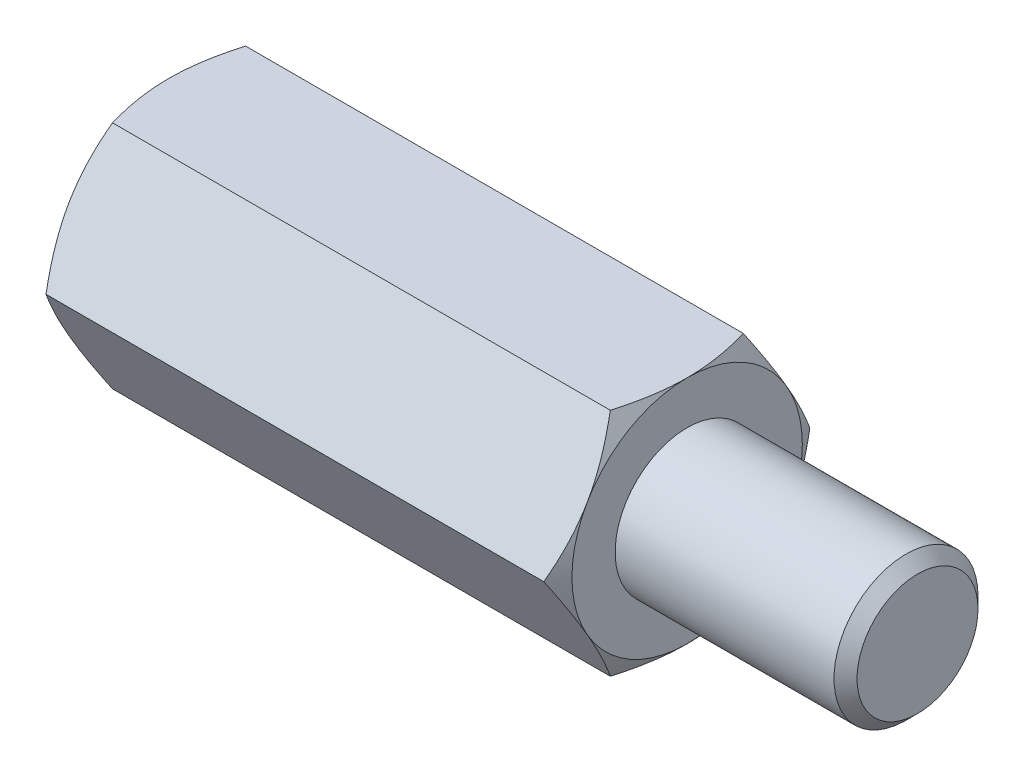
ISO-10303-21;
HEADER;
FILE_DESCRIPTION(('STEP AP214'),'2;1');
FILE_NAME('part.step','',(''),(''),'','','');
FILE_SCHEMA(('AUTOMOTIVE_DESIGN { 1 0 10303 214 1 1 1 1 }'));
ENDSEC;
DATA;
#1=APPLICATION_CONTEXT('core data for automotive mechanical design processes');
#2=APPLICATION_PROTOCOL_DEFINITION('international standard','automotive_design',2000,#1);
#3=PRODUCT_CONTEXT('',#1,'mechanical');
#4=PRODUCT('Part','Part','',(#3));
#5=PRODUCT_RELATED_PRODUCT_CATEGORY('part','',(#4));
#6=PRODUCT_DEFINITION_FORMATION('','',#4);
#7=PRODUCT_DEFINITION_CONTEXT('part definition',#1,'design');
#8=PRODUCT_DEFINITION('design','',#6,#7);
#9=PRODUCT_DEFINITION_SHAPE('','',#8);
#10=(LENGTH_UNIT() NAMED_UNIT(*) SI_UNIT(.MILLI.,.METRE.));
#11=(NAMED_UNIT(*) PLANE_ANGLE_UNIT() SI_UNIT($,.RADIAN.));
#12=(NAMED_UNIT(*) SI_UNIT($,.STERADIAN.) SOLID_ANGLE_UNIT());
#13=UNCERTAINTY_MEASURE_WITH_UNIT(LENGTH_MEASURE(1.E-05),#10,'distance_accuracy_value','');
#14=(GEOMETRIC_REPRESENTATION_CONTEXT(3) GLOBAL_UNCERTAINTY_ASSIGNED_CONTEXT((#13)) GLOBAL_UNIT_ASSIGNED_CONTEXT((#10,
#11,#12)) REPRESENTATION_CONTEXT('',''));
#15=CARTESIAN_POINT('',(0.,0.,0.));
#16=DIRECTION('',(0.,0.,1.));
#17=DIRECTION('',(1.,0.,0.));
#18=AXIS2_PLACEMENT_3D('',#15,#16,#17);
#19=CARTESIAN_POINT('',(9.,4.,-2.3094010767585));
#20=DIRECTION('',(1.,0.,0.));
#21=DIRECTION('',(0.,0.,-1.));
#22=AXIS2_PLACEMENT_3D('',#19,#20,#21);
#23=PLANE('',#22);
#24=CARTESIAN_POINT('',(9.,0.,0.));
#25=DIRECTION('',(1.,0.,0.));
#26=DIRECTION('',(0.,0.,-1.));
#27=AXIS2_PLACEMENT_3D('',#24,#25,#26);
#28=CIRCLE('',#27,4.);
#29=CARTESIAN_POINT('',(9.,-2.,-3.46410161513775));
#30=VERTEX_POINT('',#29);
#31=CARTESIAN_POINT('',(9.,2.,-3.46410161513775));
#32=VERTEX_POINT('',#31);
#33=EDGE_CURVE('E288',#30,#32,#28,.T.);
#34=ORIENTED_EDGE('',*,*,#33,.T.);
#35=CARTESIAN_POINT('',(9.,4.,0.));
#36=VERTEX_POINT('',#35);
#37=EDGE_CURVE('E53',#32,#36,#28,.T.);
#38=ORIENTED_EDGE('',*,*,#37,.T.);
#39=CARTESIAN_POINT('',(9.,2.,3.46410161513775));
#40=VERTEX_POINT('',#39);
#41=EDGE_CURVE('E296',#36,#40,#28,.T.);
#42=ORIENTED_EDGE('',*,*,#41,.T.);
#43=CARTESIAN_POINT('',(9.,-2.,3.46410161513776));
#44=VERTEX_POINT('',#43);
#45=EDGE_CURVE('E300',#40,#44,#28,.T.);
#46=ORIENTED_EDGE('',*,*,#45,.T.);
#47=CARTESIAN_POINT('',(9.,0.,0.));
#48=DIRECTION('',(-1.,0.,0.));
#49=DIRECTION('',(0.,-1.,0.));
#50=AXIS2_PLACEMENT_3D('',#47,#48,#49);
#51=CIRCLE('',#50,4.);
#52=CARTESIAN_POINT('',(9.,-4.,0.));
#53=VERTEX_POINT('',#52);
#54=EDGE_CURVE('E193',#53,#44,#51,.T.);
#55=ORIENTED_EDGE('',*,*,#54,.F.);
#56=EDGE_CURVE('E61',#53,#30,#28,.T.);
#57=ORIENTED_EDGE('',*,*,#56,.T.);
#58=EDGE_LOOP('',(#34,#38,#42,#46,#55,#57));
#59=FACE_BOUND('',#58,.T.);
#60=CARTESIAN_POINT('',(9.,0.,0.));
#61=DIRECTION('',(1.,0.,0.));
#62=DIRECTION('',(0.,0.,-1.));
#63=AXIS2_PLACEMENT_3D('',#60,#61,#62);
#64=CIRCLE('',#63,2.5);
#65=CARTESIAN_POINT('',(9.,0.,-2.5));
#66=VERTEX_POINT('',#65);
#67=EDGE_CURVE('E315',#66,#66,#64,.T.);
#68=ORIENTED_EDGE('',*,*,#67,.F.);
#69=EDGE_LOOP('',(#68));
#70=FACE_BOUND('',#69,.T.);
#71=ADVANCED_FACE('F37',(#59,#70),#23,.T.);
#72=CARTESIAN_POINT('',(9.,0.,-4.61880215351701));
#73=DIRECTION('',(0.,-0.5,0.866025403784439));
#74=DIRECTION('',(0.,-0.866025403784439,-0.5));
#75=AXIS2_PLACEMENT_3D('',#72,#73,#74);
#76=PLANE('',#75);
#77=CARTESIAN_POINT('',(8.64266774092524,-0.000200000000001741,-4.61891762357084));
#78=CARTESIAN_POINT('',(8.70128212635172,0.175579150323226,-4.5174314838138));
#79=CARTESIAN_POINT('',(8.75458967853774,0.352875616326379,-4.41506932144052));
#80=CARTESIAN_POINT('',(8.8476383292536,0.710538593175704,-4.2085725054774));
#81=CARTESIAN_POINT('',(8.8873465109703,0.890911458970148,-4.10443418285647));
#82=CARTESIAN_POINT('',(8.94915778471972,1.24942181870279,-3.89744813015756));
#83=CARTESIAN_POINT('',(8.97167226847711,1.42750415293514,-3.79463224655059));
#84=CARTESIAN_POINT('',(8.99854937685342,1.7845067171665,-3.58851671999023));
#85=CARTESIAN_POINT('',(9.00293425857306,1.9634256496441,-3.48521782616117));
#86=CARTESIAN_POINT('',(8.99380992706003,2.29774284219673,-3.29219970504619));
#87=CARTESIAN_POINT('',(8.98254104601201,2.45319115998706,-3.20245157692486));
#88=CARTESIAN_POINT('',(8.94682600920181,2.76307505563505,-3.02354002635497));
#89=CARTESIAN_POINT('',(8.92236765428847,2.91750956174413,-2.93437722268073));
#90=CARTESIAN_POINT('',(8.86122393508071,3.22803232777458,-2.75509682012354));
#91=CARTESIAN_POINT('',(8.82427939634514,3.3840812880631,-2.6650019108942));
#92=CARTESIAN_POINT('',(8.74042992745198,3.69385183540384,-2.486155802));
#93=CARTESIAN_POINT('',(8.69354469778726,3.84757739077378,-2.39740231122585));
#94=CARTESIAN_POINT('',(8.64266774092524,4.0002,-2.30928560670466));
#95=B_SPLINE_CURVE_WITH_KNOTS('',3,(#77,#78,#79,#80,#81,#82,#83,#84,#85,#86,#87,#88,#89,#90,#91,
#92,#93,#94),.UNSPECIFIED.,.F.,.F.,(4,2,2,2,2,2,2,2,4),(0.,0.634047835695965,1.26961969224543,
1.88946157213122,2.50854226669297,3.04757825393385,3.58711366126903,4.13861653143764,
4.68903648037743),.UNSPECIFIED.);
#96=CARTESIAN_POINT('',(8.64273441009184,0.,-4.61880215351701));
#97=VERTEX_POINT('',#96);
#98=EDGE_CURVE('E312',#97,#32,#95,.T.);
#99=ORIENTED_EDGE('',*,*,#98,.F.);
#100=DIRECTION('',(-1.,0.,0.));
#101=VECTOR('',#100,1.);
#102=CARTESIAN_POINT('',(9.,0.,-4.61880215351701));
#103=LINE('',#102,#101);
#104=CARTESIAN_POINT('',(-8.64273441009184,0.,-4.61880215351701));
#105=VERTEX_POINT('',#104);
#106=EDGE_CURVE('E264',#97,#105,#103,.T.);
#107=ORIENTED_EDGE('',*,*,#106,.T.);
#108=CARTESIAN_POINT('',(-8.64266774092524,4.0002,-2.30928560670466));
#109=CARTESIAN_POINT('',(-8.70128212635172,3.82442084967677,-2.4107717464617));
#110=CARTESIAN_POINT('',(-8.75458967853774,3.64712438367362,-2.51313390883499));
#111=CARTESIAN_POINT('',(-8.8476383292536,3.28946140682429,-2.71963072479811));
#112=CARTESIAN_POINT('',(-8.8873465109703,3.10908854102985,-2.82376904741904));
#113=CARTESIAN_POINT('',(-8.94915778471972,2.75057818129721,-3.03075510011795));
#114=CARTESIAN_POINT('',(-8.97167226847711,2.57249584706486,-3.13357098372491));
#115=CARTESIAN_POINT('',(-8.99854937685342,2.21549328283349,-3.33968651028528));
#116=CARTESIAN_POINT('',(-9.00293425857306,2.0365743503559,-3.44298540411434));
#117=CARTESIAN_POINT('',(-8.99380992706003,1.70225715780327,-3.63600352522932));
#118=CARTESIAN_POINT('',(-8.98254104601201,1.54680884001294,-3.72575165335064));
#119=CARTESIAN_POINT('',(-8.94682600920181,1.23692494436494,-3.90466320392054));
#120=CARTESIAN_POINT('',(-8.92236765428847,1.08249043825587,-3.99382600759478));
#121=CARTESIAN_POINT('',(-8.86122393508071,0.771967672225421,-4.17310641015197));
#122=CARTESIAN_POINT('',(-8.82427939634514,0.615918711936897,-4.26320131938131));
#123=CARTESIAN_POINT('',(-8.74042992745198,0.306148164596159,-4.4420474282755));
#124=CARTESIAN_POINT('',(-8.69354469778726,0.152422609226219,-4.53080091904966));
#125=CARTESIAN_POINT('',(-8.64266774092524,-0.000200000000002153,-4.61891762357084));
#126=B_SPLINE_CURVE_WITH_KNOTS('',3,(#108,#109,#110,#111,#112,#113,#114,#115,#116,#117,#118,
#119,#120,#121,#122,#123,#124,#125),.UNSPECIFIED.,.F.,.F.,(4,2,2,2,2,2,2,2,4),(0.,
0.634047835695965,1.26961969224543,1.88946157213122,2.50854226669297,3.04757825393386,
3.58711366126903,4.13861653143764,4.68903648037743),.UNSPECIFIED.);
#127=CARTESIAN_POINT('',(-9.,2.,-3.46410161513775));
#128=VERTEX_POINT('',#127);
#129=EDGE_CURVE('E326',#128,#105,#126,.T.);
#130=ORIENTED_EDGE('',*,*,#129,.F.);
#131=CARTESIAN_POINT('',(-8.64273441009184,4.,-2.3094010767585));
#132=VERTEX_POINT('',#131);
#133=EDGE_CURVE('E323',#132,#128,#126,.T.);
#134=ORIENTED_EDGE('',*,*,#133,.F.);
#135=DIRECTION('',(-1.,0.,0.));
#136=VECTOR('',#135,1.);
#137=CARTESIAN_POINT('',(9.,4.,-2.3094010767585));
#138=LINE('',#137,#136);
#139=CARTESIAN_POINT('',(8.64273441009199,4.,-2.30940107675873));
#140=VERTEX_POINT('',#139);
#141=EDGE_CURVE('E279',#140,#132,#138,.T.);
#142=ORIENTED_EDGE('',*,*,#141,.F.);
#143=EDGE_CURVE('E229',#32,#140,#95,.T.);
#144=ORIENTED_EDGE('',*,*,#143,.F.);
#145=EDGE_LOOP('',(#99,#107,#130,#134,#142,#144));
#146=FACE_BOUND('',#145,.T.);
#147=ADVANCED_FACE('F148',(#146),#76,.F.);
#148=CARTESIAN_POINT('',(9.,4.,-2.3094010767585));
#149=DIRECTION('',(0.,-1.,0.));
#150=DIRECTION('',(0.,0.,-1.));
#151=AXIS2_PLACEMENT_3D('',#148,#149,#150);
#152=PLANE('',#151);
#153=CARTESIAN_POINT('',(7.00829070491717,4.,-6.28479524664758));
#154=CARTESIAN_POINT('',(7.09370060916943,4.,-6.10939349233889));
#155=CARTESIAN_POINT('',(7.1783148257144,4.,-5.93359774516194));
#156=CARTESIAN_POINT('',(7.34550596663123,4.,-5.58100905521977));
#157=CARTESIAN_POINT('',(7.42808258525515,4.,-5.40421596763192));
#158=CARTESIAN_POINT('',(7.59115082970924,4.,-5.04855089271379));
#159=CARTESIAN_POINT('',(7.67162934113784,4.,-4.86967287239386));
#160=CARTESIAN_POINT('',(7.82940015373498,4.,-4.51052237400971));
#161=CARTESIAN_POINT('',(7.90669260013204,4.,-4.33024995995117));
#162=CARTESIAN_POINT('',(8.05980205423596,4.,-3.96189114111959));
#163=CARTESIAN_POINT('',(8.13548049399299,4.,-3.77374683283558));
#164=CARTESIAN_POINT('',(8.28130452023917,4.,-3.39528725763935));
#165=CARTESIAN_POINT('',(8.35144949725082,4.,-3.2049717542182));
#166=CARTESIAN_POINT('',(8.4844245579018,4.,-2.82219775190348));
#167=CARTESIAN_POINT('',(8.5472687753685,4.,-2.62974421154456));
#168=CARTESIAN_POINT('',(8.66367969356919,4.,-2.24207725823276));
#169=CARTESIAN_POINT('',(8.71724923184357,4.,-2.04686470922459));
#170=CARTESIAN_POINT('',(8.81230316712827,4.,-1.65467425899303));
#171=CARTESIAN_POINT('',(8.85385633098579,4.,-1.45771333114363));
#172=CARTESIAN_POINT('',(8.92259036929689,4.,-1.06125849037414));
#173=CARTESIAN_POINT('',(8.94977273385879,4.,-0.861764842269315));
#174=CARTESIAN_POINT('',(8.98724473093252,4.,-0.46387918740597));
#175=CARTESIAN_POINT('',(8.99775780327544,4.,-0.265508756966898));
#176=CARTESIAN_POINT('',(9.00159342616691,4.,0.131417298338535));
#177=CARTESIAN_POINT('',(8.99491584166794,4.,0.32997292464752));
#178=CARTESIAN_POINT('',(8.96964892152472,4.,0.664692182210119));
#179=CARTESIAN_POINT('',(8.95537089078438,4.,0.801202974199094));
#180=CARTESIAN_POINT('',(8.9195349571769,4.,1.07327201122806));
#181=CARTESIAN_POINT('',(8.89797613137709,4.,1.20883013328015));
#182=CARTESIAN_POINT('',(8.82350663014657,4.,1.61386939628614));
#183=CARTESIAN_POINT('',(8.76081499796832,4.,1.8815748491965));
#184=CARTESIAN_POINT('',(8.65151174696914,4.,2.28197262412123));
#185=CARTESIAN_POINT('',(8.61200931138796,4.,2.41672443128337));
#186=CARTESIAN_POINT('',(8.52875235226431,4.,2.6849206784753));
#187=CARTESIAN_POINT('',(8.48499779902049,4.,2.81836510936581));
#188=CARTESIAN_POINT('',(8.3939510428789,4.,3.08398596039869));
#189=CARTESIAN_POINT('',(8.34665989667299,4.,3.21616274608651));
#190=CARTESIAN_POINT('',(8.24911111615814,4.,3.47941134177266));
#191=CARTESIAN_POINT('',(8.1988535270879,4.,3.61048316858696));
#192=CARTESIAN_POINT('',(8.07132952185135,4.,3.93385125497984));
#193=CARTESIAN_POINT('',(7.9926014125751,4.,4.12557021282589));
#194=CARTESIAN_POINT('',(7.83096938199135,4.,4.5072455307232));
#195=CARTESIAN_POINT('',(7.74806513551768,4.,4.69720175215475));
#196=CARTESIAN_POINT('',(7.5789699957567,4.,5.0756995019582));
#197=CARTESIAN_POINT('',(7.49277827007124,4.,5.264240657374));
#198=CARTESIAN_POINT('',(7.3178011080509,4.,5.64011758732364));
#199=CARTESIAN_POINT('',(7.22901560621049,4.,5.82745333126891));
#200=CARTESIAN_POINT('',(6.95934323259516,4.,6.38844423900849));
#201=CARTESIAN_POINT('',(6.77535618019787,4.,6.76060781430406));
#202=CARTESIAN_POINT('',(6.4019562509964,4.,7.50211228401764));
#203=CARTESIAN_POINT('',(6.21254420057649,4.,7.87145359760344));
#204=CARTESIAN_POINT('',(5.84738774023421,4.,8.57450173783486));
#205=CARTESIAN_POINT('',(5.67197556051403,4.,8.90838144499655));
#206=CARTESIAN_POINT('',(5.31880976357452,4.,9.57491712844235));
#207=CARTESIAN_POINT('',(5.14105604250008,4.,9.90757304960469));
#208=CARTESIAN_POINT('',(4.78429339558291,4.,10.5709822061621));
#209=CARTESIAN_POINT('',(4.60528952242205,3.99999999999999,10.9017381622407));
#210=CARTESIAN_POINT('',(4.24590712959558,3.99999999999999,11.5624752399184));
#211=CARTESIAN_POINT('',(4.06552869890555,3.99999999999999,11.8924564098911));
#212=CARTESIAN_POINT('',(3.88464248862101,3.99999999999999,12.2221569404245));
#213=B_SPLINE_CURVE_WITH_KNOTS('',3,(#153,#154,#155,#156,#157,#158,#159,#160,#161,#162,#163,
#164,#165,#166,#167,#168,#169,#170,#171,#172,#173,#174,#175,#176,#177,#178,#179,#180,#181,#182,
#183,#184,#185,#186,#187,#188,#189,#190,#191,#192,#193,#194,#195,#196,#197,#198,#199,#200,#201,
#202,#203,#204,#205,#206,#207,#208,#209,#210,#211,#212),.UNSPECIFIED.,.F.,.F.,(4,2,2,2,2,2,2,2,
2,2,2,2,2,2,2,2,2,2,2,2,2,2,2,2,2,2,2,2,2,4),(0.,0.585280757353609,1.17064881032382,
1.75906864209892,2.34746162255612,2.95577704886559,3.56415938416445,4.17134357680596,
4.77834167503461,5.38179402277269,5.98518378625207,6.58041501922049,7.17565092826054,
7.5872191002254,7.99883946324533,8.82250155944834,9.24373134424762,9.66496407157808,
10.086071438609,10.5071723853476,11.1288656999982,11.7506074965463,12.3725077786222,
12.9944237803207,14.2398211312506,15.4850297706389,16.6164791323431,17.7479788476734,
18.8762380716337,20.0044248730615),.UNSPECIFIED.);
#214=EDGE_CURVE('E227',#140,#36,#213,.T.);
#215=ORIENTED_EDGE('',*,*,#214,.F.);
#216=ORIENTED_EDGE('',*,*,#141,.T.);
#217=CARTESIAN_POINT('',(-7.00829070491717,4.,-6.28479524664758));
#218=CARTESIAN_POINT('',(-7.09370060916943,4.,-6.10939349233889));
#219=CARTESIAN_POINT('',(-7.1783148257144,4.,-5.93359774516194));
#220=CARTESIAN_POINT('',(-7.34550596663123,4.,-5.58100905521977));
#221=CARTESIAN_POINT('',(-7.42808258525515,4.,-5.40421596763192));
#222=CARTESIAN_POINT('',(-7.59115082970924,4.,-5.04855089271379));
#223=CARTESIAN_POINT('',(-7.67162934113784,4.,-4.86967287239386));
#224=CARTESIAN_POINT('',(-7.82940015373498,4.,-4.51052237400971));
#225=CARTESIAN_POINT('',(-7.90669260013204,4.,-4.33024995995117));
#226=CARTESIAN_POINT('',(-8.05980205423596,4.,-3.96189114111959));
#227=CARTESIAN_POINT('',(-8.13548049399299,4.,-3.77374683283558));
#228=CARTESIAN_POINT('',(-8.28130452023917,4.,-3.39528725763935));
#229=CARTESIAN_POINT('',(-8.35144949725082,4.,-3.2049717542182));
#230=CARTESIAN_POINT('',(-8.4844245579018,4.,-2.82219775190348));
#231=CARTESIAN_POINT('',(-8.5472687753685,4.,-2.62974421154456));
#232=CARTESIAN_POINT('',(-8.66367969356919,4.,-2.24207725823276));
#233=CARTESIAN_POINT('',(-8.71724923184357,4.,-2.04686470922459));
#234=CARTESIAN_POINT('',(-8.81230316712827,4.,-1.65467425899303));
#235=CARTESIAN_POINT('',(-8.85385633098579,4.,-1.45771333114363));
#236=CARTESIAN_POINT('',(-8.92259036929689,4.,-1.06125849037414));
#237=CARTESIAN_POINT('',(-8.94977273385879,4.,-0.861764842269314));
#238=CARTESIAN_POINT('',(-8.98724473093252,4.,-0.46387918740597));
#239=CARTESIAN_POINT('',(-8.99775780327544,4.,-0.265508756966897));
#240=CARTESIAN_POINT('',(-9.00159342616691,4.,0.131417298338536));
#241=CARTESIAN_POINT('',(-8.99491584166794,4.,0.329972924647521));
#242=CARTESIAN_POINT('',(-8.96964892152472,4.,0.66469218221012));
#243=CARTESIAN_POINT('',(-8.95537089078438,4.,0.801202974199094));
#244=CARTESIAN_POINT('',(-8.9195349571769,4.,1.07327201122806));
#245=CARTESIAN_POINT('',(-8.89797613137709,4.,1.20883013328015));
#246=CARTESIAN_POINT('',(-8.82350663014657,4.,1.61386939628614));
#247=CARTESIAN_POINT('',(-8.76081499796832,4.,1.8815748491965));
#248=CARTESIAN_POINT('',(-8.65151174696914,4.,2.28197262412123));
#249=CARTESIAN_POINT('',(-8.61200931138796,4.,2.41672443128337));
#250=CARTESIAN_POINT('',(-8.52875235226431,4.,2.6849206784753));
#251=CARTESIAN_POINT('',(-8.48499779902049,4.,2.81836510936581));
#252=CARTESIAN_POINT('',(-8.3939510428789,4.,3.08398596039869));
#253=CARTESIAN_POINT('',(-8.34665989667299,4.,3.21616274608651));
#254=CARTESIAN_POINT('',(-8.24911111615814,4.,3.47941134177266));
#255=CARTESIAN_POINT('',(-8.1988535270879,4.,3.61048316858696));
#256=CARTESIAN_POINT('',(-8.07132952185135,4.,3.93385125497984));
#257=CARTESIAN_POINT('',(-7.9926014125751,4.,4.1255702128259));
#258=CARTESIAN_POINT('',(-7.83096938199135,4.,4.5072455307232));
#259=CARTESIAN_POINT('',(-7.74806513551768,4.,4.69720175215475));
#260=CARTESIAN_POINT('',(-7.5789699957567,4.,5.0756995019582));
#261=CARTESIAN_POINT('',(-7.49277827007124,4.,5.264240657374));
#262=CARTESIAN_POINT('',(-7.3178011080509,4.,5.64011758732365));
#263=CARTESIAN_POINT('',(-7.22901560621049,4.,5.82745333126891));
#264=CARTESIAN_POINT('',(-6.95934323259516,4.,6.3884442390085));
#265=CARTESIAN_POINT('',(-6.77535618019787,4.,6.76060781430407));
#266=CARTESIAN_POINT('',(-6.4019562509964,4.,7.50211228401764));
#267=CARTESIAN_POINT('',(-6.21254420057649,4.,7.87145359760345));
#268=CARTESIAN_POINT('',(-5.84738774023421,4.,8.57450173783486));
#269=CARTESIAN_POINT('',(-5.67197556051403,4.,8.90838144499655));
#270=CARTESIAN_POINT('',(-5.31880976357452,4.,9.57491712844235));
#271=CARTESIAN_POINT('',(-5.14105604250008,4.,9.90757304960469));
#272=CARTESIAN_POINT('',(-4.78429339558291,4.,10.5709822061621));
#273=CARTESIAN_POINT('',(-4.60528952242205,3.99999999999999,10.9017381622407));
#274=CARTESIAN_POINT('',(-4.24590712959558,3.99999999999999,11.5624752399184));
#275=CARTESIAN_POINT('',(-4.06552869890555,3.99999999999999,11.8924564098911));
#276=CARTESIAN_POINT('',(-3.88464248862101,3.99999999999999,12.2221569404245));
#277=B_SPLINE_CURVE_WITH_KNOTS('',3,(#217,#218,#219,#220,#221,#222,#223,#224,#225,#226,#227,
#228,#229,#230,#231,#232,#233,#234,#235,#236,#237,#238,#239,#240,#241,#242,#243,#244,#245,#246,
#247,#248,#249,#250,#251,#252,#253,#254,#255,#256,#257,#258,#259,#260,#261,#262,#263,#264,#265,
#266,#267,#268,#269,#270,#271,#272,#273,#274,#275,#276),.UNSPECIFIED.,.F.,.F.,(4,2,2,2,2,2,2,2,
2,2,2,2,2,2,2,2,2,2,2,2,2,2,2,2,2,2,2,2,2,4),(0.,0.585280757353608,1.17064881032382,
1.75906864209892,2.34746162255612,2.95577704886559,3.56415938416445,4.17134357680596,
4.77834167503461,5.38179402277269,5.98518378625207,6.58041501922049,7.17565092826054,
7.5872191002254,7.99883946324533,8.82250155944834,9.24373134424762,9.66496407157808,
10.086071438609,10.5071723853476,11.1288656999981,11.7506074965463,12.3725077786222,
12.9944237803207,14.2398211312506,15.4850297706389,16.6164791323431,17.7479788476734,
18.8762380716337,20.0044248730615),.UNSPECIFIED.);
#278=CARTESIAN_POINT('',(-9.,4.,0.));
#279=VERTEX_POINT('',#278);
#280=EDGE_CURVE('E241',#279,#132,#277,.F.);
#281=ORIENTED_EDGE('',*,*,#280,.F.);
#282=CARTESIAN_POINT('',(-8.64273441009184,4.,2.3094010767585));
#283=VERTEX_POINT('',#282);
#284=EDGE_CURVE('E249',#283,#279,#277,.F.);
#285=ORIENTED_EDGE('',*,*,#284,.F.);
#286=DIRECTION('',(-1.,0.,0.));
#287=VECTOR('',#286,1.);
#288=CARTESIAN_POINT('',(9.,4.,2.3094010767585));
#289=LINE('',#288,#287);
#290=CARTESIAN_POINT('',(8.64273441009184,4.,2.3094010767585));
#291=VERTEX_POINT('',#290);
#292=EDGE_CURVE('E276',#291,#283,#289,.T.);
#293=ORIENTED_EDGE('',*,*,#292,.F.);
#294=EDGE_CURVE('E221',#36,#291,#213,.T.);
#295=ORIENTED_EDGE('',*,*,#294,.F.);
#296=EDGE_LOOP('',(#215,#216,#281,#285,#293,#295));
#297=FACE_BOUND('',#296,.T.);
#298=ADVANCED_FACE('F153',(#297),#152,.F.);
#299=CARTESIAN_POINT('',(9.,4.,2.3094010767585));
#300=DIRECTION('',(0.,-0.5,-0.866025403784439));
#301=DIRECTION('',(0.,0.866025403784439,-0.5));
#302=AXIS2_PLACEMENT_3D('',#299,#300,#301);
#303=PLANE('',#302);
#304=CARTESIAN_POINT('',(8.64266774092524,4.0002,2.30928560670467));
#305=CARTESIAN_POINT('',(8.70128212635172,3.82442084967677,2.4107717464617));
#306=CARTESIAN_POINT('',(8.75458967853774,3.64712438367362,2.51313390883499));
#307=CARTESIAN_POINT('',(8.8476383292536,3.28946140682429,2.71963072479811));
#308=CARTESIAN_POINT('',(8.8873465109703,3.10908854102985,2.82376904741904));
#309=CARTESIAN_POINT('',(8.94915778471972,2.75057818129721,3.03075510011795));
#310=CARTESIAN_POINT('',(8.97167226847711,2.57249584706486,3.13357098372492));
#311=CARTESIAN_POINT('',(8.99854937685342,2.21549328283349,3.33968651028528));
#312=CARTESIAN_POINT('',(9.00293425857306,2.0365743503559,3.44298540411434));
#313=CARTESIAN_POINT('',(8.99380992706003,1.70225715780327,3.63600352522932));
#314=CARTESIAN_POINT('',(8.98254104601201,1.54680884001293,3.72575165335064));
#315=CARTESIAN_POINT('',(8.94682600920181,1.23692494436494,3.90466320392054));
#316=CARTESIAN_POINT('',(8.92236765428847,1.08249043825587,3.99382600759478));
#317=CARTESIAN_POINT('',(8.86122393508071,0.771967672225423,4.17310641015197));
#318=CARTESIAN_POINT('',(8.82427939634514,0.615918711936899,4.26320131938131));
#319=CARTESIAN_POINT('',(8.74042992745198,0.306148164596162,4.4420474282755));
#320=CARTESIAN_POINT('',(8.69354469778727,0.152422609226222,4.53080091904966));
#321=CARTESIAN_POINT('',(8.64266774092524,-0.000199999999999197,4.61891762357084));
#322=B_SPLINE_CURVE_WITH_KNOTS('',3,(#304,#305,#306,#307,#308,#309,#310,#311,#312,#313,#314,
#315,#316,#317,#318,#319,#320,#321),.UNSPECIFIED.,.F.,.F.,(4,2,2,2,2,2,2,2,4),(0.,
0.634047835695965,1.26961969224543,1.88946157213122,2.50854226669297,3.04757825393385,
3.58711366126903,4.13861653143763,4.68903648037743),.UNSPECIFIED.);
#323=EDGE_CURVE('E228',#291,#40,#322,.T.);
#324=ORIENTED_EDGE('',*,*,#323,.F.);
#325=ORIENTED_EDGE('',*,*,#292,.T.);
#326=CARTESIAN_POINT('',(-8.64266774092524,-0.000199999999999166,4.61891762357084));
#327=CARTESIAN_POINT('',(-8.70128212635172,0.175579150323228,4.5174314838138));
#328=CARTESIAN_POINT('',(-8.75458967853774,0.352875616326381,4.41506932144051));
#329=CARTESIAN_POINT('',(-8.8476383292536,0.710538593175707,4.20857250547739));
#330=CARTESIAN_POINT('',(-8.8873465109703,0.890911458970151,4.10443418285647));
#331=CARTESIAN_POINT('',(-8.94915778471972,1.24942181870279,3.89744813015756));
#332=CARTESIAN_POINT('',(-8.97167226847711,1.42750415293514,3.79463224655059));
#333=CARTESIAN_POINT('',(-8.99854937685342,1.78450671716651,3.58851671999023));
#334=CARTESIAN_POINT('',(-9.00293425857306,1.9634256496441,3.48521782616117));
#335=CARTESIAN_POINT('',(-8.99380992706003,2.29774284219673,3.29219970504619));
#336=CARTESIAN_POINT('',(-8.98254104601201,2.45319115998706,3.20245157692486));
#337=CARTESIAN_POINT('',(-8.94682600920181,2.76307505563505,3.02354002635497));
#338=CARTESIAN_POINT('',(-8.92236765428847,2.91750956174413,2.93437722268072));
#339=CARTESIAN_POINT('',(-8.86122393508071,3.22803232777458,2.75509682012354));
#340=CARTESIAN_POINT('',(-8.82427939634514,3.3840812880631,2.6650019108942));
#341=CARTESIAN_POINT('',(-8.74042992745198,3.69385183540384,2.48615580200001));
#342=CARTESIAN_POINT('',(-8.69354469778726,3.84757739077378,2.39740231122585));
#343=CARTESIAN_POINT('',(-8.64266774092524,4.0002,2.30928560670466));
#344=B_SPLINE_CURVE_WITH_KNOTS('',3,(#326,#327,#328,#329,#330,#331,#332,#333,#334,#335,#336,
#337,#338,#339,#340,#341,#342,#343),.UNSPECIFIED.,.F.,.F.,(4,2,2,2,2,2,2,2,4),(0.,
0.634047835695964,1.26961969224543,1.88946157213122,2.50854226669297,3.04757825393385,
3.58711366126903,4.13861653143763,4.68903648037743),.UNSPECIFIED.);
#345=CARTESIAN_POINT('',(-9.,2.,3.46410161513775));
#346=VERTEX_POINT('',#345);
#347=EDGE_CURVE('E255',#346,#283,#344,.T.);
#348=ORIENTED_EDGE('',*,*,#347,.F.);
#349=CARTESIAN_POINT('',(-8.64273441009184,0.,4.618802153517));
#350=VERTEX_POINT('',#349);
#351=EDGE_CURVE('E262',#350,#346,#344,.T.);
#352=ORIENTED_EDGE('',*,*,#351,.F.);
#353=DIRECTION('',(-1.,0.,0.));
#354=VECTOR('',#353,1.);
#355=CARTESIAN_POINT('',(9.,0.,4.618802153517));
#356=LINE('',#355,#354);
#357=CARTESIAN_POINT('',(8.64273441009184,0.,4.618802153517));
#358=VERTEX_POINT('',#357);
#359=EDGE_CURVE('E273',#358,#350,#356,.T.);
#360=ORIENTED_EDGE('',*,*,#359,.F.);
#361=EDGE_CURVE('E215',#40,#358,#322,.T.);
#362=ORIENTED_EDGE('',*,*,#361,.F.);
#363=EDGE_LOOP('',(#324,#325,#348,#352,#360,#362));
#364=FACE_BOUND('',#363,.T.);
#365=ADVANCED_FACE('F235',(#364),#303,.F.);
#366=CARTESIAN_POINT('',(9.,0.,4.618802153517));
#367=DIRECTION('',(0.,0.5,-0.866025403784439));
#368=DIRECTION('',(0.,0.866025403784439,0.5));
#369=AXIS2_PLACEMENT_3D('',#366,#367,#368);
#370=PLANE('',#369);
#371=CARTESIAN_POINT('',(8.64266774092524,0.000200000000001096,4.61891762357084));
#372=CARTESIAN_POINT('',(8.70128212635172,-0.175579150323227,4.5174314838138));
#373=CARTESIAN_POINT('',(8.75458967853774,-0.352875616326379,4.41506932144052));
#374=CARTESIAN_POINT('',(8.8476383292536,-0.710538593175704,4.20857250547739));
#375=CARTESIAN_POINT('',(8.8873465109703,-0.890911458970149,4.10443418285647));
#376=CARTESIAN_POINT('',(8.94915778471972,-1.24942181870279,3.89744813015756));
#377=CARTESIAN_POINT('',(8.97167226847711,-1.42750415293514,3.79463224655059));
#378=CARTESIAN_POINT('',(8.99854937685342,-1.78450671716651,3.58851671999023));
#379=CARTESIAN_POINT('',(9.00293425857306,-1.9634256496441,3.48521782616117));
#380=CARTESIAN_POINT('',(8.99380992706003,-2.29774284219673,3.29219970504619));
#381=CARTESIAN_POINT('',(8.98254104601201,-2.45319115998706,3.20245157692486));
#382=CARTESIAN_POINT('',(8.94682600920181,-2.76307505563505,3.02354002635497));
#383=CARTESIAN_POINT('',(8.92236765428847,-2.91750956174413,2.93437722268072));
#384=CARTESIAN_POINT('',(8.86122393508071,-3.22803232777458,2.75509682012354));
#385=CARTESIAN_POINT('',(8.82427939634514,-3.3840812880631,2.6650019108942));
#386=CARTESIAN_POINT('',(8.74042992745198,-3.69385183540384,2.48615580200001));
#387=CARTESIAN_POINT('',(8.69354469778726,-3.84757739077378,2.39740231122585));
#388=CARTESIAN_POINT('',(8.64266774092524,-4.0002,2.30928560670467));
#389=B_SPLINE_CURVE_WITH_KNOTS('',3,(#371,#372,#373,#374,#375,#376,#377,#378,#379,#380,#381,
#382,#383,#384,#385,#386,#387,#388),.UNSPECIFIED.,.F.,.F.,(4,2,2,2,2,2,2,2,4),(0.,
0.634047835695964,1.26961969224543,1.88946157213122,2.50854226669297,3.04757825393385,
3.58711366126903,4.13861653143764,4.68903648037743),.UNSPECIFIED.);
#390=EDGE_CURVE('E332',#358,#44,#389,.T.);
#391=ORIENTED_EDGE('',*,*,#390,.F.);
#392=ORIENTED_EDGE('',*,*,#359,.T.);
#393=CARTESIAN_POINT('',(-8.64266774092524,-4.0002,2.30928560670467));
#394=CARTESIAN_POINT('',(-8.70128212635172,-3.82442084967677,2.4107717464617));
#395=CARTESIAN_POINT('',(-8.75458967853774,-3.64712438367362,2.51313390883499));
#396=CARTESIAN_POINT('',(-8.8476383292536,-3.28946140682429,2.71963072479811));
#397=CARTESIAN_POINT('',(-8.8873465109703,-3.10908854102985,2.82376904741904));
#398=CARTESIAN_POINT('',(-8.94915778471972,-2.75057818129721,3.03075510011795));
#399=CARTESIAN_POINT('',(-8.97167226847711,-2.57249584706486,3.13357098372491));
#400=CARTESIAN_POINT('',(-8.99854937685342,-2.21549328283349,3.33968651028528));
#401=CARTESIAN_POINT('',(-9.00293425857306,-2.0365743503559,3.44298540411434));
#402=CARTESIAN_POINT('',(-8.99380992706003,-1.70225715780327,3.63600352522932));
#403=CARTESIAN_POINT('',(-8.98254104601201,-1.54680884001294,3.72575165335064));
#404=CARTESIAN_POINT('',(-8.94682600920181,-1.23692494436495,3.90466320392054));
#405=CARTESIAN_POINT('',(-8.92236765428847,-1.08249043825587,3.99382600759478));
#406=CARTESIAN_POINT('',(-8.86122393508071,-0.771967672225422,4.17310641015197));
#407=CARTESIAN_POINT('',(-8.82427939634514,-0.615918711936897,4.26320131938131));
#408=CARTESIAN_POINT('',(-8.74042992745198,-0.30614816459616,4.4420474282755));
#409=CARTESIAN_POINT('',(-8.69354469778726,-0.15242260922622,4.53080091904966));
#410=CARTESIAN_POINT('',(-8.64266774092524,0.000200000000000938,4.61891762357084));
#411=B_SPLINE_CURVE_WITH_KNOTS('',3,(#393,#394,#395,#396,#397,#398,#399,#400,#401,#402,#403,
#404,#405,#406,#407,#408,#409,#410),.UNSPECIFIED.,.F.,.F.,(4,2,2,2,2,2,2,2,4),(0.,
0.634047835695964,1.26961969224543,1.88946157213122,2.50854226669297,3.04757825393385,
3.58711366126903,4.13861653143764,4.68903648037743),.UNSPECIFIED.);
#412=CARTESIAN_POINT('',(-9.,-2.,3.46410161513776));
#413=VERTEX_POINT('',#412);
#414=EDGE_CURVE('E263',#413,#350,#411,.T.);
#415=ORIENTED_EDGE('',*,*,#414,.F.);
#416=CARTESIAN_POINT('',(-8.64273441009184,-4.,2.3094010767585));
#417=VERTEX_POINT('',#416);
#418=EDGE_CURVE('E250',#417,#413,#411,.T.);
#419=ORIENTED_EDGE('',*,*,#418,.F.);
#420=DIRECTION('',(-1.,0.,0.));
#421=VECTOR('',#420,1.);
#422=CARTESIAN_POINT('',(9.,-4.,2.3094010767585));
#423=LINE('',#422,#421);
#424=CARTESIAN_POINT('',(8.64273441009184,-4.,2.3094010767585));
#425=VERTEX_POINT('',#424);
#426=EDGE_CURVE('E270',#425,#417,#423,.T.);
#427=ORIENTED_EDGE('',*,*,#426,.F.);
#428=EDGE_CURVE('E210',#44,#425,#389,.T.);
#429=ORIENTED_EDGE('',*,*,#428,.F.);
#430=EDGE_LOOP('',(#391,#392,#415,#419,#427,#429));
#431=FACE_BOUND('',#430,.T.);
#432=ADVANCED_FACE('F378',(#431),#370,.F.);
#433=CARTESIAN_POINT('',(9.,-4.,2.3094010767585));
#434=DIRECTION('',(0.,1.,0.));
#435=DIRECTION('',(0.,0.,1.));
#436=AXIS2_PLACEMENT_3D('',#433,#434,#435);
#437=PLANE('',#436);
#438=CARTESIAN_POINT('',(7.0082907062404,-4.,-6.28479524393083));
#439=CARTESIAN_POINT('',(7.09370061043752,-4.,-6.10939348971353));
#440=CARTESIAN_POINT('',(7.17831482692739,-4.,-5.93359774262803));
#441=CARTESIAN_POINT('',(7.34550596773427,-4.,-5.58100905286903));
#442=CARTESIAN_POINT('',(7.42808258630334,-4.,-5.40421596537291));
#443=CARTESIAN_POINT('',(7.59115083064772,-4.,-5.04855089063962));
#444=CARTESIAN_POINT('',(7.67162934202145,-4.,-4.86967287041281));
#445=CARTESIAN_POINT('',(7.82940015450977,-4.,-4.51052237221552));
#446=CARTESIAN_POINT('',(7.90669260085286,-4.,-4.33024995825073));
#447=CARTESIAN_POINT('',(8.05980205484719,-4.,-3.96189113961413));
#448=CARTESIAN_POINT('',(8.13548049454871,-4.,-3.77374683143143));
#449=CARTESIAN_POINT('',(8.28130452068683,-4.,-3.39528725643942));
#450=CARTESIAN_POINT('',(8.35144949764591,-4.,-3.2049717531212));
#451=CARTESIAN_POINT('',(8.48442455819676,-4.,-2.82219775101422));
#452=CARTESIAN_POINT('',(8.54726877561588,-4.,-2.62974421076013));
#453=CARTESIAN_POINT('',(8.66367969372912,-4.,-2.24207725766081));
#454=CARTESIAN_POINT('',(8.71724923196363,-4.,-2.04686470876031));
#455=CARTESIAN_POINT('',(8.81230316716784,-4.,-1.65467425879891));
#456=CARTESIAN_POINT('',(8.85385633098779,-4.,-1.45771333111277));
#457=CARTESIAN_POINT('',(8.9225903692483,-4.,-1.06125849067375));
#458=CARTESIAN_POINT('',(8.94977273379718,-4.,-0.861764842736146));
#459=CARTESIAN_POINT('',(8.98724473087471,-4.,-0.463879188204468));
#460=CARTESIAN_POINT('',(8.99775780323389,-4.,-0.265508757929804));
#461=CARTESIAN_POINT('',(9.00159342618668,-4.,0.13141729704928));
#462=CARTESIAN_POINT('',(8.99491584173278,-4.,0.329972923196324));
#463=CARTESIAN_POINT('',(8.96964892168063,-4.,0.664692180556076));
#464=CARTESIAN_POINT('',(8.95537089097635,-4.,0.801202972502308));
#465=CARTESIAN_POINT('',(8.9195349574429,-4.,1.07327200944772));
#466=CARTESIAN_POINT('',(8.89797613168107,-4.,1.20883013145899));
#467=CARTESIAN_POINT('',(8.82350663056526,-4.,1.6138693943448));
#468=CARTESIAN_POINT('',(8.76081499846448,-4.,1.88157484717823));
#469=CARTESIAN_POINT('',(8.65151174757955,-4.,2.28197262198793));
#470=CARTESIAN_POINT('',(8.6120093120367,-4.,2.41672442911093));
#471=CARTESIAN_POINT('',(8.52875235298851,-4.,2.68492067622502));
#472=CARTESIAN_POINT('',(8.48499779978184,-4.,2.81836510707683));
#473=CARTESIAN_POINT('',(8.39395104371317,-4.,3.08398595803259));
#474=CARTESIAN_POINT('',(8.34665989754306,-4.,3.216162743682));
#475=CARTESIAN_POINT('',(8.24911111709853,-4.,3.47941133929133));
#476=CARTESIAN_POINT('',(8.19885352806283,-4.,3.61048316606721));
#477=CARTESIAN_POINT('',(8.07132952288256,-4.,3.93385125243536));
#478=CARTESIAN_POINT('',(7.99260141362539,-4.,4.12557021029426));
#479=CARTESIAN_POINT('',(7.830969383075,-4.,4.50724552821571));
#480=CARTESIAN_POINT('',(7.74806513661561,-4.,4.69720174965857));
#481=CARTESIAN_POINT('',(7.57896999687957,-4.,5.07569949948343));
#482=CARTESIAN_POINT('',(7.49277827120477,-4.,5.26424065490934));
#483=CARTESIAN_POINT('',(7.31780110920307,-4.,5.64011758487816));
#484=CARTESIAN_POINT('',(7.22901560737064,-4.,5.82745332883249));
#485=CARTESIAN_POINT('',(6.95934323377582,-4.,6.38844423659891));
#486=CARTESIAN_POINT('',(6.77535618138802,-4.,6.76060781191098));
#487=CARTESIAN_POINT('',(6.40195625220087,-4.,7.50211228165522));
#488=CARTESIAN_POINT('',(6.2125442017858,-4.,7.87145359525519));
#489=CARTESIAN_POINT('',(5.84738774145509,-4.,8.57450173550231));
#490=CARTESIAN_POINT('',(5.671975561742,-4.,8.90838144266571));
#491=CARTESIAN_POINT('',(5.3188097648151,-4.,9.5749171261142));
#492=CARTESIAN_POINT('',(5.1410560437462,-4.,9.90757304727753));
#493=CARTESIAN_POINT('',(4.78429339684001,-4.,10.5709822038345));
#494=CARTESIAN_POINT('',(4.60528952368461,-4.,10.9017381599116));
#495=CARTESIAN_POINT('',(4.24590713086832,-4.,11.562475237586));
#496=CARTESIAN_POINT('',(4.06552870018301,-4.,11.8924564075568));
#497=CARTESIAN_POINT('',(3.88464248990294,-4.,12.2221569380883));
#498=B_SPLINE_CURVE_WITH_KNOTS('',3,(#438,#439,#440,#441,#442,#443,#444,#445,#446,#447,#448,
#449,#450,#451,#452,#453,#454,#455,#456,#457,#458,#459,#460,#461,#462,#463,#464,#465,#466,#467,
#468,#469,#470,#471,#472,#473,#474,#475,#476,#477,#478,#479,#480,#481,#482,#483,#484,#485,#486,
#487,#488,#489,#490,#491,#492,#493,#494,#495,#496,#497),.UNSPECIFIED.,.F.,.F.,(4,2,2,2,2,2,2,2,
2,2,2,2,2,2,2,2,2,2,2,2,2,2,2,2,2,2,2,2,2,4),(0.,0.585280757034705,1.17064880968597,
1.75906864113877,2.34746162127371,2.95577704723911,3.56415938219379,4.17134357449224,
4.7783416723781,5.38179401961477,5.98518378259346,6.58041501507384,7.1756509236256,
7.5872190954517,7.99883945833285,8.82250155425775,9.24373133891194,9.66496406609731,
10.0860714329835,10.5071723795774,11.1288656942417,11.7506074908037,12.3725077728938,
12.9944237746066,14.2398211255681,15.4850297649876,16.6164791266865,17.7479788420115,
18.8762380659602,20.0044248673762),.UNSPECIFIED.);
#499=EDGE_CURVE('E333',#425,#53,#498,.F.);
#500=ORIENTED_EDGE('',*,*,#499,.F.);
#501=ORIENTED_EDGE('',*,*,#426,.T.);
#502=CARTESIAN_POINT('',(-7.0082907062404,-4.,-6.28479524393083));
#503=CARTESIAN_POINT('',(-7.09370061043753,-4.,-6.10939348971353));
#504=CARTESIAN_POINT('',(-7.1783148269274,-4.,-5.93359774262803));
#505=CARTESIAN_POINT('',(-7.34550596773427,-4.,-5.58100905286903));
#506=CARTESIAN_POINT('',(-7.42808258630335,-4.,-5.40421596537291));
#507=CARTESIAN_POINT('',(-7.59115083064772,-4.,-5.04855089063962));
#508=CARTESIAN_POINT('',(-7.67162934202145,-4.,-4.86967287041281));
#509=CARTESIAN_POINT('',(-7.82940015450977,-4.,-4.51052237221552));
#510=CARTESIAN_POINT('',(-7.90669260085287,-4.,-4.33024995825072));
#511=CARTESIAN_POINT('',(-8.05980205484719,-4.,-3.96189113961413));
#512=CARTESIAN_POINT('',(-8.13548049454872,-4.,-3.77374683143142));
#513=CARTESIAN_POINT('',(-8.28130452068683,-4.,-3.39528725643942));
#514=CARTESIAN_POINT('',(-8.35144949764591,-4.,-3.2049717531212));
#515=CARTESIAN_POINT('',(-8.48442455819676,-4.,-2.82219775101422));
#516=CARTESIAN_POINT('',(-8.54726877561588,-4.,-2.62974421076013));
#517=CARTESIAN_POINT('',(-8.66367969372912,-4.,-2.24207725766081));
#518=CARTESIAN_POINT('',(-8.71724923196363,-4.,-2.04686470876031));
#519=CARTESIAN_POINT('',(-8.81230316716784,-4.,-1.65467425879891));
#520=CARTESIAN_POINT('',(-8.85385633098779,-4.,-1.45771333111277));
#521=CARTESIAN_POINT('',(-8.9225903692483,-4.,-1.06125849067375));
#522=CARTESIAN_POINT('',(-8.94977273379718,-4.,-0.861764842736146));
#523=CARTESIAN_POINT('',(-8.98724473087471,-4.,-0.463879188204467));
#524=CARTESIAN_POINT('',(-8.99775780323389,-4.,-0.265508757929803));
#525=CARTESIAN_POINT('',(-9.00159342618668,-4.,0.131417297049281));
#526=CARTESIAN_POINT('',(-8.99491584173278,-4.,0.329972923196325));
#527=CARTESIAN_POINT('',(-8.96964892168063,-4.,0.664692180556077));
#528=CARTESIAN_POINT('',(-8.95537089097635,-4.,0.80120297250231));
#529=CARTESIAN_POINT('',(-8.9195349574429,-4.,1.07327200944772));
#530=CARTESIAN_POINT('',(-8.89797613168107,-4.,1.208830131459));
#531=CARTESIAN_POINT('',(-8.82350663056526,-4.,1.6138693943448));
#532=CARTESIAN_POINT('',(-8.76081499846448,-4.,1.88157484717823));
#533=CARTESIAN_POINT('',(-8.65151174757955,-4.,2.28197262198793));
#534=CARTESIAN_POINT('',(-8.6120093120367,-4.,2.41672442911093));
#535=CARTESIAN_POINT('',(-8.52875235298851,-4.,2.68492067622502));
#536=CARTESIAN_POINT('',(-8.48499779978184,-4.,2.81836510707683));
#537=CARTESIAN_POINT('',(-8.39395104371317,-4.,3.0839859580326));
#538=CARTESIAN_POINT('',(-8.34665989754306,-4.,3.21616274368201));
#539=CARTESIAN_POINT('',(-8.24911111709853,-4.,3.47941133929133));
#540=CARTESIAN_POINT('',(-8.19885352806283,-4.,3.61048316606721));
#541=CARTESIAN_POINT('',(-8.07132952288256,-4.,3.93385125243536));
#542=CARTESIAN_POINT('',(-7.99260141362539,-4.,4.12557021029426));
#543=CARTESIAN_POINT('',(-7.830969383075,-4.,4.50724552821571));
#544=CARTESIAN_POINT('',(-7.74806513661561,-4.,4.69720174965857));
#545=CARTESIAN_POINT('',(-7.57896999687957,-4.,5.07569949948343));
#546=CARTESIAN_POINT('',(-7.49277827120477,-4.,5.26424065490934));
#547=CARTESIAN_POINT('',(-7.31780110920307,-4.,5.64011758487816));
#548=CARTESIAN_POINT('',(-7.22901560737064,-4.,5.82745332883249));
#549=CARTESIAN_POINT('',(-6.95934323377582,-4.,6.38844423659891));
#550=CARTESIAN_POINT('',(-6.77535618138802,-4.,6.76060781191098));
#551=CARTESIAN_POINT('',(-6.40195625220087,-4.,7.50211228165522));
#552=CARTESIAN_POINT('',(-6.2125442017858,-4.,7.87145359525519));
#553=CARTESIAN_POINT('',(-5.84738774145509,-4.,8.57450173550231));
#554=CARTESIAN_POINT('',(-5.671975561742,-4.,8.90838144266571));
#555=CARTESIAN_POINT('',(-5.3188097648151,-4.,9.5749171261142));
#556=CARTESIAN_POINT('',(-5.1410560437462,-4.,9.90757304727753));
#557=CARTESIAN_POINT('',(-4.78429339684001,-4.,10.5709822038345));
#558=CARTESIAN_POINT('',(-4.60528952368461,-4.,10.9017381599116));
#559=CARTESIAN_POINT('',(-4.24590713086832,-4.,11.562475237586));
#560=CARTESIAN_POINT('',(-4.06552870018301,-4.,11.8924564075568));
#561=CARTESIAN_POINT('',(-3.88464248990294,-4.,12.2221569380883));
#562=B_SPLINE_CURVE_WITH_KNOTS('',3,(#502,#503,#504,#505,#506,#507,#508,#509,#510,#511,#512,
#513,#514,#515,#516,#517,#518,#519,#520,#521,#522,#523,#524,#525,#526,#527,#528,#529,#530,#531,
#532,#533,#534,#535,#536,#537,#538,#539,#540,#541,#542,#543,#544,#545,#546,#547,#548,#549,#550,
#551,#552,#553,#554,#555,#556,#557,#558,#559,#560,#561),.UNSPECIFIED.,.F.,.F.,(4,2,2,2,2,2,2,2,
2,2,2,2,2,2,2,2,2,2,2,2,2,2,2,2,2,2,2,2,2,4),(0.,0.585280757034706,1.17064880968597,
1.75906864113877,2.34746162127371,2.95577704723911,3.56415938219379,4.17134357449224,
4.7783416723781,5.38179401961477,5.98518378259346,6.58041501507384,7.1756509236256,
7.5872190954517,7.99883945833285,8.82250155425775,9.24373133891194,9.66496406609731,
10.0860714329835,10.5071723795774,11.1288656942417,11.7506074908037,12.3725077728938,
12.9944237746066,14.2398211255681,15.4850297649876,16.6164791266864,17.7479788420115,
18.8762380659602,20.0044248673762),.UNSPECIFIED.);
#563=CARTESIAN_POINT('',(-9.,-4.,0.));
#564=VERTEX_POINT('',#563);
#565=EDGE_CURVE('E325',#564,#417,#562,.T.);
#566=ORIENTED_EDGE('',*,*,#565,.F.);
#567=CARTESIAN_POINT('',(-8.64273441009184,-4.,-2.3094010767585));
#568=VERTEX_POINT('',#567);
#569=EDGE_CURVE('E328',#568,#564,#562,.T.);
#570=ORIENTED_EDGE('',*,*,#569,.F.);
#571=DIRECTION('',(-1.,0.,0.));
#572=VECTOR('',#571,1.);
#573=CARTESIAN_POINT('',(9.,-4.,-2.3094010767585));
#574=LINE('',#573,#572);
#575=CARTESIAN_POINT('',(8.64273441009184,-4.,-2.3094010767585));
#576=VERTEX_POINT('',#575);
#577=EDGE_CURVE('E267',#576,#568,#574,.T.);
#578=ORIENTED_EDGE('',*,*,#577,.F.);
#579=EDGE_CURVE('E195',#53,#576,#498,.F.);
#580=ORIENTED_EDGE('',*,*,#579,.F.);
#581=EDGE_LOOP('',(#500,#501,#566,#570,#578,#580));
#582=FACE_BOUND('',#581,.T.);
#583=ADVANCED_FACE('F172',(#582),#437,.F.);
#584=CARTESIAN_POINT('',(9.,-4.,-2.3094010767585));
#585=DIRECTION('',(0.,0.5,0.866025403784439));
#586=DIRECTION('',(0.,-0.866025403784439,0.5));
#587=AXIS2_PLACEMENT_3D('',#584,#585,#586);
#588=PLANE('',#587);
#589=CARTESIAN_POINT('',(8.64266774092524,-4.0002,-2.30928560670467));
#590=CARTESIAN_POINT('',(8.70128212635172,-3.82442084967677,-2.41077174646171));
#591=CARTESIAN_POINT('',(8.75458967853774,-3.64712438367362,-2.513133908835));
#592=CARTESIAN_POINT('',(8.8476383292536,-3.28946140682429,-2.71963072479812));
#593=CARTESIAN_POINT('',(8.88734651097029,-3.10908854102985,-2.82376904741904));
#594=CARTESIAN_POINT('',(8.94915778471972,-2.75057818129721,-3.03075510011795));
#595=CARTESIAN_POINT('',(8.97167226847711,-2.57249584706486,-3.13357098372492));
#596=CARTESIAN_POINT('',(8.99854937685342,-2.21549328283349,-3.33968651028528));
#597=CARTESIAN_POINT('',(9.00293425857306,-2.0365743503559,-3.44298540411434));
#598=CARTESIAN_POINT('',(8.99380992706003,-1.70225715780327,-3.63600352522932));
#599=CARTESIAN_POINT('',(8.982541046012,-1.54680884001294,-3.72575165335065));
#600=CARTESIAN_POINT('',(8.94682600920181,-1.23692494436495,-3.90466320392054));
#601=CARTESIAN_POINT('',(8.92236765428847,-1.08249043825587,-3.99382600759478));
#602=CARTESIAN_POINT('',(8.86122393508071,-0.771967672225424,-4.17310641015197));
#603=CARTESIAN_POINT('',(8.82427939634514,-0.6159187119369,-4.26320131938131));
#604=CARTESIAN_POINT('',(8.74042992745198,-0.306148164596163,-4.4420474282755));
#605=CARTESIAN_POINT('',(8.69354469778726,-0.152422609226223,-4.53080091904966));
#606=CARTESIAN_POINT('',(8.64266774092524,0.000199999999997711,-4.61891762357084));
#607=B_SPLINE_CURVE_WITH_KNOTS('',3,(#589,#590,#591,#592,#593,#594,#595,#596,#597,#598,#599,
#600,#601,#602,#603,#604,#605,#606),.UNSPECIFIED.,.F.,.F.,(4,2,2,2,2,2,2,2,4),(0.,
0.634047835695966,1.26961969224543,1.88946157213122,2.50854226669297,3.04757825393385,
3.58711366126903,4.13861653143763,4.68903648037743),.UNSPECIFIED.);
#608=EDGE_CURVE('E192',#576,#30,#607,.T.);
#609=ORIENTED_EDGE('',*,*,#608,.F.);
#610=ORIENTED_EDGE('',*,*,#577,.T.);
#611=CARTESIAN_POINT('',(-8.64266774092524,0.000199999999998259,-4.61891762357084));
#612=CARTESIAN_POINT('',(-8.70128212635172,-0.17557915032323,-4.5174314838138));
#613=CARTESIAN_POINT('',(-8.75458967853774,-0.352875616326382,-4.41506932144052));
#614=CARTESIAN_POINT('',(-8.8476383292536,-0.710538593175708,-4.20857250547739));
#615=CARTESIAN_POINT('',(-8.8873465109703,-0.890911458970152,-4.10443418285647));
#616=CARTESIAN_POINT('',(-8.94915778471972,-1.24942181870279,-3.89744813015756));
#617=CARTESIAN_POINT('',(-8.97167226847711,-1.42750415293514,-3.79463224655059));
#618=CARTESIAN_POINT('',(-8.99854937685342,-1.78450671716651,-3.58851671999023));
#619=CARTESIAN_POINT('',(-9.00293425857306,-1.9634256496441,-3.48521782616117));
#620=CARTESIAN_POINT('',(-8.99380992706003,-2.29774284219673,-3.29219970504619));
#621=CARTESIAN_POINT('',(-8.982541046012,-2.45319115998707,-3.20245157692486));
#622=CARTESIAN_POINT('',(-8.94682600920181,-2.76307505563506,-3.02354002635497));
#623=CARTESIAN_POINT('',(-8.92236765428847,-2.91750956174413,-2.93437722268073));
#624=CARTESIAN_POINT('',(-8.86122393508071,-3.22803232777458,-2.75509682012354));
#625=CARTESIAN_POINT('',(-8.82427939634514,-3.3840812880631,-2.6650019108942));
#626=CARTESIAN_POINT('',(-8.74042992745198,-3.69385183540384,-2.48615580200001));
#627=CARTESIAN_POINT('',(-8.69354469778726,-3.84757739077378,-2.39740231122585));
#628=CARTESIAN_POINT('',(-8.64266774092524,-4.0002,-2.30928560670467));
#629=B_SPLINE_CURVE_WITH_KNOTS('',3,(#611,#612,#613,#614,#615,#616,#617,#618,#619,#620,#621,
#622,#623,#624,#625,#626,#627,#628),.UNSPECIFIED.,.F.,.F.,(4,2,2,2,2,2,2,2,4),(0.,
0.634047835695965,1.26961969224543,1.88946157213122,2.50854226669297,3.04757825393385,
3.58711366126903,4.13861653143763,4.68903648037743),.UNSPECIFIED.);
#630=CARTESIAN_POINT('',(-9.,-2.,-3.46410161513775));
#631=VERTEX_POINT('',#630);
#632=EDGE_CURVE('E178',#631,#568,#629,.T.);
#633=ORIENTED_EDGE('',*,*,#632,.F.);
#634=EDGE_CURVE('E348',#105,#631,#629,.T.);
#635=ORIENTED_EDGE('',*,*,#634,.F.);
#636=ORIENTED_EDGE('',*,*,#106,.F.);
#637=EDGE_CURVE('E185',#30,#97,#607,.T.);
#638=ORIENTED_EDGE('',*,*,#637,.F.);
#639=EDGE_LOOP('',(#609,#610,#633,#635,#636,#638));
#640=FACE_BOUND('',#639,.T.);
#641=ADVANCED_FACE('F167',(#640),#588,.F.);
#642=CARTESIAN_POINT('',(-9.,0.,0.));
#643=DIRECTION('',(1.,0.,0.));
#644=DIRECTION('',(0.,1.,0.));
#645=AXIS2_PLACEMENT_3D('',#642,#643,#644);
#646=CONICAL_SURFACE('',#645,4.,1.0471975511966);
#647=ORIENTED_EDGE('',*,*,#129,.T.);
#648=ORIENTED_EDGE('',*,*,#634,.T.);
#649=CARTESIAN_POINT('',(-9.,0.,0.));
#650=DIRECTION('',(1.,0.,0.));
#651=DIRECTION('',(0.,0.,-1.));
#652=AXIS2_PLACEMENT_3D('',#649,#650,#651);
#653=CIRCLE('',#652,4.);
#654=EDGE_CURVE('E282',#631,#128,#653,.T.);
#655=ORIENTED_EDGE('',*,*,#654,.T.);
#656=EDGE_LOOP('',(#647,#648,#655));
#657=FACE_BOUND('',#656,.T.);
#658=ADVANCED_FACE('F171',(#657),#646,.T.);
#659=ORIENTED_EDGE('',*,*,#569,.T.);
#660=EDGE_CURVE('E286',#564,#631,#653,.T.);
#661=ORIENTED_EDGE('',*,*,#660,.T.);
#662=ORIENTED_EDGE('',*,*,#632,.T.);
#663=EDGE_LOOP('',(#659,#661,#662));
#664=FACE_BOUND('',#663,.T.);
#665=ADVANCED_FACE('F415',(#664),#646,.T.);
#666=ORIENTED_EDGE('',*,*,#418,.T.);
#667=CARTESIAN_POINT('',(-9.,0.,0.));
#668=DIRECTION('',(-1.,0.,0.));
#669=DIRECTION('',(0.,-1.,0.));
#670=AXIS2_PLACEMENT_3D('',#667,#668,#669);
#671=CIRCLE('',#670,4.);
#672=EDGE_CURVE('E314',#564,#413,#671,.T.);
#673=ORIENTED_EDGE('',*,*,#672,.F.);
#674=ORIENTED_EDGE('',*,*,#565,.T.);
#675=EDGE_LOOP('',(#666,#673,#674));
#676=FACE_BOUND('',#675,.T.);
#677=ADVANCED_FACE('F417',(#676),#646,.T.);
#678=ORIENTED_EDGE('',*,*,#351,.T.);
#679=EDGE_CURVE('E371',#346,#413,#653,.T.);
#680=ORIENTED_EDGE('',*,*,#679,.T.);
#681=ORIENTED_EDGE('',*,*,#414,.T.);
#682=EDGE_LOOP('',(#678,#680,#681));
#683=FACE_BOUND('',#682,.T.);
#684=ADVANCED_FACE('F158',(#683),#646,.T.);
#685=ORIENTED_EDGE('',*,*,#347,.T.);
#686=ORIENTED_EDGE('',*,*,#284,.T.);
#687=EDGE_CURVE('E354',#279,#346,#653,.T.);
#688=ORIENTED_EDGE('',*,*,#687,.T.);
#689=EDGE_LOOP('',(#685,#686,#688));
#690=FACE_BOUND('',#689,.T.);
#691=ADVANCED_FACE('F389',(#690),#646,.T.);
#692=ORIENTED_EDGE('',*,*,#280,.T.);
#693=ORIENTED_EDGE('',*,*,#133,.T.);
#694=EDGE_CURVE('E287',#128,#279,#653,.T.);
#695=ORIENTED_EDGE('',*,*,#694,.T.);
#696=EDGE_LOOP('',(#692,#693,#695));
#697=FACE_BOUND('',#696,.T.);
#698=ADVANCED_FACE('F165',(#697),#646,.T.);
#699=CARTESIAN_POINT('',(-9.,4.,-2.3094010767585));
#700=DIRECTION('',(1.,0.,0.));
#701=DIRECTION('',(0.,0.,-1.));
#702=AXIS2_PLACEMENT_3D('',#699,#700,#701);
#703=PLANE('',#702);
#704=CARTESIAN_POINT('',(-9.,0.,0.));
#705=DIRECTION('',(-1.,0.,0.));
#706=DIRECTION('',(0.,0.,1.));
#707=AXIS2_PLACEMENT_3D('',#704,#705,#706);
#708=CIRCLE('',#707,2.1);
#709=CARTESIAN_POINT('',(-9.,0.,2.1));
#710=VERTEX_POINT('',#709);
#711=EDGE_CURVE('E346',#710,#710,#708,.T.);
#712=ORIENTED_EDGE('',*,*,#711,.F.);
#713=EDGE_LOOP('',(#712));
#714=FACE_BOUND('',#713,.T.);
#715=ORIENTED_EDGE('',*,*,#694,.F.);
#716=ORIENTED_EDGE('',*,*,#654,.F.);
#717=ORIENTED_EDGE('',*,*,#660,.F.);
#718=ORIENTED_EDGE('',*,*,#672,.T.);
#719=ORIENTED_EDGE('',*,*,#679,.F.);
#720=ORIENTED_EDGE('',*,*,#687,.F.);
#721=EDGE_LOOP('',(#715,#716,#717,#718,#719,#720));
#722=FACE_BOUND('',#721,.T.);
#723=ADVANCED_FACE('F161',(#714,#722),#703,.F.);
#724=CARTESIAN_POINT('',(9.,0.,0.));
#725=DIRECTION('',(-1.,0.,0.));
#726=DIRECTION('',(0.,1.,0.));
#727=AXIS2_PLACEMENT_3D('',#724,#725,#726);
#728=CONICAL_SURFACE('',#727,4.,1.0471975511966);
#729=ORIENTED_EDGE('',*,*,#98,.T.);
#730=ORIENTED_EDGE('',*,*,#33,.F.);
#731=ORIENTED_EDGE('',*,*,#637,.T.);
#732=EDGE_LOOP('',(#729,#730,#731));
#733=FACE_BOUND('',#732,.T.);
#734=ADVANCED_FACE('F164',(#733),#728,.T.);
#735=ORIENTED_EDGE('',*,*,#579,.T.);
#736=ORIENTED_EDGE('',*,*,#608,.T.);
#737=ORIENTED_EDGE('',*,*,#56,.F.);
#738=EDGE_LOOP('',(#735,#736,#737));
#739=FACE_BOUND('',#738,.T.);
#740=ADVANCED_FACE('F202',(#739),#728,.T.);
#741=ORIENTED_EDGE('',*,*,#428,.T.);
#742=ORIENTED_EDGE('',*,*,#499,.T.);
#743=ORIENTED_EDGE('',*,*,#54,.T.);
#744=EDGE_LOOP('',(#741,#742,#743));
#745=FACE_BOUND('',#744,.T.);
#746=ADVANCED_FACE('F442',(#745),#728,.T.);
#747=ORIENTED_EDGE('',*,*,#361,.T.);
#748=ORIENTED_EDGE('',*,*,#390,.T.);
#749=ORIENTED_EDGE('',*,*,#45,.F.);
#750=EDGE_LOOP('',(#747,#748,#749));
#751=FACE_BOUND('',#750,.T.);
#752=ADVANCED_FACE('F448',(#751),#728,.T.);
#753=ORIENTED_EDGE('',*,*,#294,.T.);
#754=ORIENTED_EDGE('',*,*,#323,.T.);
#755=ORIENTED_EDGE('',*,*,#41,.F.);
#756=EDGE_LOOP('',(#753,#754,#755));
#757=FACE_BOUND('',#756,.T.);
#758=ADVANCED_FACE('F454',(#757),#728,.T.);
#759=ORIENTED_EDGE('',*,*,#143,.T.);
#760=ORIENTED_EDGE('',*,*,#214,.T.);
#761=ORIENTED_EDGE('',*,*,#37,.F.);
#762=EDGE_LOOP('',(#759,#760,#761));
#763=FACE_BOUND('',#762,.T.);
#764=ADVANCED_FACE('F143',(#763),#728,.T.);
#765=CARTESIAN_POINT('',(-0.999999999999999,0.,0.));
#766=DIRECTION('',(-1.,0.,0.));
#767=DIRECTION('',(0.,0.,1.));
#768=AXIS2_PLACEMENT_3D('',#765,#766,#767);
#769=CYLINDRICAL_SURFACE('',#768,2.1);
#770=CARTESIAN_POINT('',(-0.999999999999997,0.,0.));
#771=DIRECTION('',(1.,0.,0.));
#772=DIRECTION('',(0.,0.,-1.));
#773=AXIS2_PLACEMENT_3D('',#770,#771,#772);
#774=CIRCLE('',#773,2.1);
#775=CARTESIAN_POINT('',(-0.999999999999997,0.,-2.1));
#776=VERTEX_POINT('',#775);
#777=EDGE_CURVE('E317',#776,#776,#774,.T.);
#778=ORIENTED_EDGE('',*,*,#777,.T.);
#779=EDGE_LOOP('',(#778));
#780=FACE_BOUND('',#779,.T.);
#781=ORIENTED_EDGE('',*,*,#711,.T.);
#782=EDGE_LOOP('',(#781));
#783=FACE_BOUND('',#782,.T.);
#784=ADVANCED_FACE('F133',(#780,#783),#769,.F.);
#785=CARTESIAN_POINT('',(0.212435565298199,0.,0.));
#786=DIRECTION('',(-1.,0.,0.));
#787=DIRECTION('',(0.,0.,1.));
#788=AXIS2_PLACEMENT_3D('',#785,#786,#787);
#789=CONICAL_SURFACE('',#788,0.,1.0471975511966);
#790=ORIENTED_EDGE('',*,*,#777,.F.);
#791=EDGE_LOOP('',(#790));
#792=FACE_BOUND('',#791,.T.);
#793=CARTESIAN_POINT('',(0.212435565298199,0.,0.));
#794=VERTEX_POINT('',#793);
#795=VERTEX_LOOP('',#794);
#796=FACE_BOUND('',#795,.T.);
#797=ADVANCED_FACE('F130',(#792,#796),#789,.F.);
#798=CARTESIAN_POINT('',(17.,0.,0.));
#799=DIRECTION('',(-1.,0.,0.));
#800=DIRECTION('',(0.,0.,1.));
#801=AXIS2_PLACEMENT_3D('',#798,#799,#800);
#802=CYLINDRICAL_SURFACE('',#801,2.5);
#803=CARTESIAN_POINT('',(16.6,0.,0.));
#804=DIRECTION('',(1.,0.,0.));
#805=DIRECTION('',(0.,0.,-1.));
#806=AXIS2_PLACEMENT_3D('',#803,#804,#805);
#807=CIRCLE('',#806,2.5);
#808=CARTESIAN_POINT('',(16.6,0.,-2.5));
#809=VERTEX_POINT('',#808);
#810=EDGE_CURVE('E11',#809,#809,#807,.F.);
#811=ORIENTED_EDGE('',*,*,#810,.T.);
#812=EDGE_LOOP('',(#811));
#813=FACE_BOUND('',#812,.T.);
#814=ORIENTED_EDGE('',*,*,#67,.T.);
#815=EDGE_LOOP('',(#814));
#816=FACE_BOUND('',#815,.T.);
#817=ADVANCED_FACE('F132',(#813,#816),#802,.T.);
#818=CARTESIAN_POINT('',(17.,0.,0.));
#819=DIRECTION('',(1.,0.,0.));
#820=DIRECTION('',(0.,0.,-1.));
#821=AXIS2_PLACEMENT_3D('',#818,#819,#820);
#822=PLANE('',#821);
#823=CARTESIAN_POINT('',(17.,0.,0.));
#824=DIRECTION('',(1.,0.,0.));
#825=DIRECTION('',(0.,0.,-1.));
#826=AXIS2_PLACEMENT_3D('',#823,#824,#825);
#827=CIRCLE('',#826,2.1);
#828=CARTESIAN_POINT('',(17.,0.,-2.1));
#829=VERTEX_POINT('',#828);
#830=EDGE_CURVE('E46',#829,#829,#827,.T.);
#831=ORIENTED_EDGE('',*,*,#830,.T.);
#832=EDGE_LOOP('',(#831));
#833=FACE_BOUND('',#832,.T.);
#834=ADVANCED_FACE('F140',(#833),#822,.T.);
#835=CARTESIAN_POINT('',(17.,0.,0.));
#836=DIRECTION('',(-1.,0.,0.));
#837=DIRECTION('',(0.,0.,1.));
#838=AXIS2_PLACEMENT_3D('',#835,#836,#837);
#839=CONICAL_SURFACE('',#838,2.1,0.785398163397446);
#840=ORIENTED_EDGE('',*,*,#810,.F.);
#841=EDGE_LOOP('',(#840));
#842=FACE_BOUND('',#841,.T.);
#843=ORIENTED_EDGE('',*,*,#830,.F.);
#844=EDGE_LOOP('',(#843));
#845=FACE_BOUND('',#844,.T.);
#846=ADVANCED_FACE('F39',(#842,#845),#839,.T.);
#847=CLOSED_SHELL('',(#71,#147,#298,#365,#432,#583,#641,#658,#665,#677,#684,#691,#698,#723,#734,
#740,#746,#752,#758,#764,#784,#797,#817,#834,#846));
#848=MANIFOLD_SOLID_BREP('B2',#847);
#849=ADVANCED_BREP_SHAPE_REPRESENTATION('',(#18,#848),#14);
#850=SHAPE_DEFINITION_REPRESENTATION(#9,#849);
ENDSEC;
END-ISO-10303-21;
